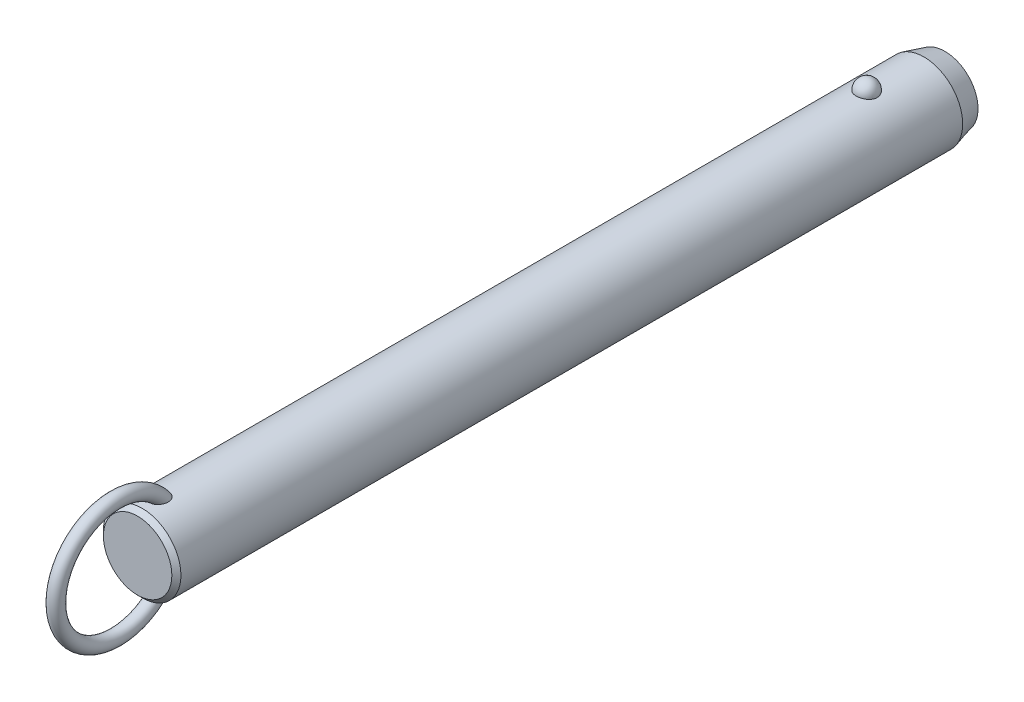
ISO-10303-21;
HEADER;
FILE_DESCRIPTION(('STEP AP214'),'2;1');
FILE_NAME('part.step','',(''),(''),'','','');
FILE_SCHEMA(('AUTOMOTIVE_DESIGN { 1 0 10303 214 1 1 1 1 }'));
ENDSEC;
DATA;
#1=APPLICATION_CONTEXT('core data for automotive mechanical design processes');
#2=APPLICATION_PROTOCOL_DEFINITION('international standard','automotive_design',2000,#1);
#3=PRODUCT_CONTEXT('',#1,'mechanical');
#4=PRODUCT('Part','Part','',(#3));
#5=PRODUCT_RELATED_PRODUCT_CATEGORY('part','',(#4));
#6=PRODUCT_DEFINITION_FORMATION('','',#4);
#7=PRODUCT_DEFINITION_CONTEXT('part definition',#1,'design');
#8=PRODUCT_DEFINITION('design','',#6,#7);
#9=PRODUCT_DEFINITION_SHAPE('','',#8);
#10=(LENGTH_UNIT() NAMED_UNIT(*) SI_UNIT(.MILLI.,.METRE.));
#11=(NAMED_UNIT(*) PLANE_ANGLE_UNIT() SI_UNIT($,.RADIAN.));
#12=(NAMED_UNIT(*) SI_UNIT($,.STERADIAN.) SOLID_ANGLE_UNIT());
#13=UNCERTAINTY_MEASURE_WITH_UNIT(LENGTH_MEASURE(1.E-05),#10,'distance_accuracy_value','');
#14=(GEOMETRIC_REPRESENTATION_CONTEXT(3) GLOBAL_UNCERTAINTY_ASSIGNED_CONTEXT((#13)) GLOBAL_UNIT_ASSIGNED_CONTEXT((#10,
#11,#12)) REPRESENTATION_CONTEXT('',''));
#15=CARTESIAN_POINT('',(0.,0.,0.));
#16=DIRECTION('',(0.,0.,1.));
#17=DIRECTION('',(1.,0.,0.));
#18=AXIS2_PLACEMENT_3D('',#15,#16,#17);
#19=CARTESIAN_POINT('',(0.,0.,193.));
#20=DIRECTION('',(0.,0.,-1.));
#21=DIRECTION('',(-1.,0.,0.));
#22=AXIS2_PLACEMENT_3D('',#19,#20,#21);
#23=CYLINDRICAL_SURFACE('',#22,11.1);
#24=CARTESIAN_POINT('',(2.9724815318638,10.6945945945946,-3.00000000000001));
#25=CARTESIAN_POINT('',(2.97247830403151,10.6945972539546,-2.8322505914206));
#26=CARTESIAN_POINT('',(2.95876598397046,10.6984356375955,-2.66445972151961));
#27=CARTESIAN_POINT('',(2.90424529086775,10.7133624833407,-2.3336238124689));
#28=CARTESIAN_POINT('',(2.8634252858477,10.7244540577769,-2.17058084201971));
#29=CARTESIAN_POINT('',(2.75573657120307,10.7526272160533,-1.85396767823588));
#30=CARTESIAN_POINT('',(2.68887937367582,10.7697061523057,-1.70039333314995));
#31=CARTESIAN_POINT('',(2.53079696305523,10.8079438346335,-1.4069159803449));
#32=CARTESIAN_POINT('',(2.43957264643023,10.8291024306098,-1.26701246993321));
#33=CARTESIAN_POINT('',(2.23458150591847,10.8732541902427,-1.00409565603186));
#34=CARTESIAN_POINT('',(2.12071295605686,10.8962553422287,-0.881162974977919));
#35=CARTESIAN_POINT('',(1.87365402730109,10.9414421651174,-0.656352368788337));
#36=CARTESIAN_POINT('',(1.74046358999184,10.9636278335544,-0.554474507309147));
#37=CARTESIAN_POINT('',(1.45872188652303,11.0046495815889,-0.374872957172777));
#38=CARTESIAN_POINT('',(1.31021276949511,11.0234944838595,-0.297085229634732));
#39=CARTESIAN_POINT('',(1.00170030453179,11.0557957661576,-0.167529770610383));
#40=CARTESIAN_POINT('',(0.841698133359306,11.0692526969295,-0.1157593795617));
#41=CARTESIAN_POINT('',(0.517607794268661,11.0890932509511,-0.0403925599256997));
#42=CARTESIAN_POINT('',(0.353633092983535,11.0955916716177,-0.0163383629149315));
#43=CARTESIAN_POINT('',(0.0238420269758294,11.1011989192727,0.00445177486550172));
#44=CARTESIAN_POINT('',(-0.141974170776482,11.1003084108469,0.00119017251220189));
#45=CARTESIAN_POINT('',(-0.468405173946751,11.0912990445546,-0.0323233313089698));
#46=CARTESIAN_POINT('',(-0.629059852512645,11.0832767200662,-0.062214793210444));
#47=CARTESIAN_POINT('',(-0.942937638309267,11.0609962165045,-0.147645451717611));
#48=CARTESIAN_POINT('',(-1.09616062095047,11.0467379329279,-0.203185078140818));
#49=CARTESIAN_POINT('',(-1.39181061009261,11.0134071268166,-0.338752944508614));
#50=CARTESIAN_POINT('',(-1.53417383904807,10.9943086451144,-0.418913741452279));
#51=CARTESIAN_POINT('',(-1.80342160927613,10.9533667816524,-0.601448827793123));
#52=CARTESIAN_POINT('',(-1.9303046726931,10.9315231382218,-0.703825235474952));
#53=CARTESIAN_POINT('',(-2.16747598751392,10.887005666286,-0.930091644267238));
#54=CARTESIAN_POINT('',(-2.27742774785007,10.8643239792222,-1.05433291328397));
#55=CARTESIAN_POINT('',(-2.47517316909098,10.8209886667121,-1.31966633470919));
#56=CARTESIAN_POINT('',(-2.56296538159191,10.8003351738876,-1.46075958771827));
#57=CARTESIAN_POINT('',(-2.71500300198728,10.7631304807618,-1.75753646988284));
#58=CARTESIAN_POINT('',(-2.77898901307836,10.7466250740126,-1.91335887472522));
#59=CARTESIAN_POINT('',(-2.88046189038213,10.7198747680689,-2.23391529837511));
#60=CARTESIAN_POINT('',(-2.91794947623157,10.709629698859,-2.3986490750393));
#61=CARTESIAN_POINT('',(-2.96537819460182,10.6965949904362,-2.73165170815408));
#62=CARTESIAN_POINT('',(-2.97542891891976,10.693775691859,-2.89990378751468));
#63=CARTESIAN_POINT('',(-2.96804271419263,10.6958279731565,-3.23575286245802));
#64=CARTESIAN_POINT('',(-2.95060646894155,10.7006993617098,-3.4033498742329));
#65=CARTESIAN_POINT('',(-2.88883358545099,10.71753912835,-3.73233906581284));
#66=CARTESIAN_POINT('',(-2.84462026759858,10.7294749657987,-3.89375610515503));
#67=CARTESIAN_POINT('',(-2.73050447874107,10.7590797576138,-4.20667949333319));
#68=CARTESIAN_POINT('',(-2.66060103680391,10.7767489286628,-4.35818546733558));
#69=CARTESIAN_POINT('',(-2.49642559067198,10.8159599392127,-4.64785421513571));
#70=CARTESIAN_POINT('',(-2.40203047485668,10.8375211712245,-4.78594458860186));
#71=CARTESIAN_POINT('',(-2.19143488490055,10.8820570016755,-5.04410382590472));
#72=CARTESIAN_POINT('',(-2.07523364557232,10.9050316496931,-5.16417205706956));
#73=CARTESIAN_POINT('',(-1.82361254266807,10.9499219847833,-5.3833483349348));
#74=CARTESIAN_POINT('',(-1.68812945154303,10.9718338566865,-5.48238464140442));
#75=CARTESIAN_POINT('',(-1.40191298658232,11.0120611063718,-5.65618873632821));
#76=CARTESIAN_POINT('',(-1.25118062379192,11.0303767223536,-5.73095813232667));
#77=CARTESIAN_POINT('',(-0.940570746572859,11.0611653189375,-5.85334725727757));
#78=CARTESIAN_POINT('',(-0.780821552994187,11.0737044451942,-5.90127578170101));
#79=CARTESIAN_POINT('',(-0.455204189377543,11.0918598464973,-5.96992976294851));
#80=CARTESIAN_POINT('',(-0.289336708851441,11.0974768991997,-5.99065827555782));
#81=CARTESIAN_POINT('',(0.0406846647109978,11.1011307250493,-6.00418773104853));
#82=CARTESIAN_POINT('',(0.204817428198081,11.099299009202,-5.9974731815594));
#83=CARTESIAN_POINT('',(0.5295530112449,11.088551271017,-5.95740317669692));
#84=CARTESIAN_POINT('',(0.69015594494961,11.0796354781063,-5.92404858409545));
#85=CARTESIAN_POINT('',(1.0027760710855,11.0557204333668,-5.83180084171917));
#86=CARTESIAN_POINT('',(1.15482001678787,11.0407414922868,-5.7729929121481));
#87=CARTESIAN_POINT('',(1.44678373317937,11.0062913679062,-5.63147366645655));
#88=CARTESIAN_POINT('',(1.58670279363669,10.9868199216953,-5.54876095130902));
#89=CARTESIAN_POINT('',(1.8527023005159,10.9451315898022,-5.36027644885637));
#90=CARTESIAN_POINT('',(1.97855158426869,10.9228788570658,-5.25418644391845));
#91=CARTESIAN_POINT('',(2.21080872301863,10.8782509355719,-5.02251354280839));
#92=CARTESIAN_POINT('',(2.31721312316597,10.8558757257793,-4.89692718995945));
#93=CARTESIAN_POINT('',(2.5094551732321,10.8130715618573,-4.62745408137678));
#94=CARTESIAN_POINT('',(2.59493284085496,10.7926798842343,-4.48330448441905));
#95=CARTESIAN_POINT('',(2.740862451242,10.7565495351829,-4.18236358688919));
#96=CARTESIAN_POINT('',(2.80132490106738,10.7408089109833,-4.02557762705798));
#97=CARTESIAN_POINT('',(2.88959070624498,10.7173718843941,-3.72475308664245));
#98=CARTESIAN_POINT('',(2.92062102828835,10.7088950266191,-3.58171216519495));
#99=CARTESIAN_POINT('',(2.96206765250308,10.6975052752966,-3.29245795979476));
#100=CARTESIAN_POINT('',(2.97248434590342,10.6945922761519,-3.14624473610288));
#101=CARTESIAN_POINT('',(2.9724815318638,10.6945945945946,-3.00000000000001));
#102=B_SPLINE_CURVE_WITH_KNOTS('',3,(#24,#25,#26,#27,#28,#29,#30,#31,#32,#33,#34,#35,#36,#37,
#38,#39,#40,#41,#42,#43,#44,#45,#46,#47,#48,#49,#50,#51,#52,#53,#54,#55,#56,#57,#58,#59,#60,#61,
#62,#63,#64,#65,#66,#67,#68,#69,#70,#71,#72,#73,#74,#75,#76,#77,#78,#79,#80,#81,#82,#83,#84,#85,
#86,#87,#88,#89,#90,#91,#92,#93,#94,#95,#96,#97,#98,#99,#100,#101),.UNSPECIFIED.,.T.,.F.,(4,2,2,
2,2,2,2,2,2,2,2,2,2,2,2,2,2,2,2,2,2,2,2,2,2,2,2,2,2,2,2,2,2,2,2,2,2,2,4),(0.,0.502722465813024,
1.00566079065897,1.5083769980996,2.01107471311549,2.51608392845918,3.02109467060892,
3.52475118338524,4.02835620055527,4.523518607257,5.0186364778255,5.50715297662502,
5.9956776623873,6.48688002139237,6.97812923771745,7.47814366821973,7.9781907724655,
8.48353712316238,8.9888697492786,9.49218093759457,9.99547960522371,10.4964777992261,
10.997494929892,11.5010810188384,12.0046847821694,12.5099796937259,13.0152411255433,
13.5145635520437,14.0138298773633,14.5043200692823,14.9947943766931,15.4836390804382,
15.9725123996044,16.4685040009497,16.9645836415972,17.4686765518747,17.972557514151,
18.410841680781,18.849117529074),.UNSPECIFIED.);
#103=CARTESIAN_POINT('',(2.9724815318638,10.6945945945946,-3.00000000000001));
#104=VERTEX_POINT('',#103);
#105=EDGE_CURVE('E41',#104,#104,#102,.T.);
#106=ORIENTED_EDGE('',*,*,#105,.T.);
#107=EDGE_LOOP('',(#106));
#108=FACE_BOUND('',#107,.T.);
#109=CARTESIAN_POINT('',(0.,0.,204.4));
#110=DIRECTION('',(0.,0.,1.));
#111=DIRECTION('',(1.,0.,0.));
#112=AXIS2_PLACEMENT_3D('',#109,#110,#111);
#113=CIRCLE('',#112,11.1);
#114=CARTESIAN_POINT('',(11.1,0.,204.4));
#115=VERTEX_POINT('',#114);
#116=EDGE_CURVE('E10',#115,#115,#113,.F.);
#117=ORIENTED_EDGE('',*,*,#116,.T.);
#118=EDGE_LOOP('',(#117));
#119=FACE_BOUND('',#118,.T.);
#120=CARTESIAN_POINT('',(-0.564520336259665,-11.0856356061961,196.657815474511));
#121=CARTESIAN_POINT('',(-0.667202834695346,-11.0804062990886,196.691283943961));
#122=CARTESIAN_POINT('',(-0.766875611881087,-11.0738877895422,196.733835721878));
#123=CARTESIAN_POINT('',(-0.95728412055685,-11.0590576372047,196.835419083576));
#124=CARTESIAN_POINT('',(-1.04801616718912,-11.0507452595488,196.89445742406));
#125=CARTESIAN_POINT('',(-1.21800952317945,-11.0333016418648,197.026529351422));
#126=CARTESIAN_POINT('',(-1.2973080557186,-11.0241732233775,197.099515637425));
#127=CARTESIAN_POINT('',(-1.44337665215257,-11.0060026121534,197.257037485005));
#128=CARTESIAN_POINT('',(-1.51014622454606,-10.9969604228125,197.341573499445));
#129=CARTESIAN_POINT('',(-1.63454620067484,-10.9791841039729,197.525521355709));
#130=CARTESIAN_POINT('',(-1.69127003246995,-10.9705107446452,197.625549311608));
#131=CARTESIAN_POINT('',(-1.7898078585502,-10.9548648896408,197.832790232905));
#132=CARTESIAN_POINT('',(-1.83161214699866,-10.9478935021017,197.940007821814));
#133=CARTESIAN_POINT('',(-1.91557028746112,-10.9335803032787,198.205408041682));
#134=CARTESIAN_POINT('',(-1.95040620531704,-10.9273269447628,198.365980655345));
#135=CARTESIAN_POINT('',(-1.99388326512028,-10.9194709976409,198.690697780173));
#136=CARTESIAN_POINT('',(-2.00248051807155,-10.9178762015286,198.854847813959));
#137=CARTESIAN_POINT('',(-1.99551615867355,-10.9191578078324,199.224650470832));
#138=CARTESIAN_POINT('',(-1.9732206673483,-10.9232807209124,199.430191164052));
#139=CARTESIAN_POINT('',(-1.9152976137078,-10.9335244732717,199.733595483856));
#140=CARTESIAN_POINT('',(-1.89184575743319,-10.9376266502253,199.834088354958));
#141=CARTESIAN_POINT('',(-1.83700674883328,-10.9469720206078,200.032855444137));
#142=CARTESIAN_POINT('',(-1.80562070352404,-10.9522150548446,200.131129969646));
#143=CARTESIAN_POINT('',(-1.73463055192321,-10.9636837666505,200.325914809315));
#144=CARTESIAN_POINT('',(-1.69493416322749,-10.9699202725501,200.422390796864));
#145=CARTESIAN_POINT('',(-1.60745141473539,-10.9830806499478,200.611626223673));
#146=CARTESIAN_POINT('',(-1.55966150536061,-10.9900048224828,200.704384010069));
#147=CARTESIAN_POINT('',(-1.45591812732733,-11.0042280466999,200.884690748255));
#148=CARTESIAN_POINT('',(-1.40000013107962,-11.0115253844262,200.972260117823));
#149=CARTESIAN_POINT('',(-1.27937470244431,-11.0261911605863,201.141029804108));
#150=CARTESIAN_POINT('',(-1.21467835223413,-11.0335594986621,201.22223795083));
#151=CARTESIAN_POINT('',(-1.08218150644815,-11.0473027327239,201.369001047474));
#152=CARTESIAN_POINT('',(-1.01522633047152,-11.0537063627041,201.435309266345));
#153=CARTESIAN_POINT('',(-0.872952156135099,-11.065850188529,201.558378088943));
#154=CARTESIAN_POINT('',(-0.797642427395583,-11.0715911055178,201.615149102));
#155=CARTESIAN_POINT('',(-0.651396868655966,-11.081071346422,201.707515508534));
#156=CARTESIAN_POINT('',(-0.581712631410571,-11.0849841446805,201.745049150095));
#157=CARTESIAN_POINT('',(-0.437066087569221,-11.0916271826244,201.808259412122));
#158=CARTESIAN_POINT('',(-0.362109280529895,-11.0943586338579,201.833948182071));
#159=CARTESIAN_POINT('',(-0.207828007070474,-11.0983242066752,201.871117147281));
#160=CARTESIAN_POINT('',(-0.12846771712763,-11.0995432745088,201.882454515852));
#161=CARTESIAN_POINT('',(0.0309101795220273,-11.1002423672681,201.888965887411));
#162=CARTESIAN_POINT('',(0.110927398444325,-11.0997233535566,201.884148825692));
#163=CARTESIAN_POINT('',(0.25640659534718,-11.097240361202,201.860959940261));
#164=CARTESIAN_POINT('',(0.322235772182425,-11.0955074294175,201.844754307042));
#165=CARTESIAN_POINT('',(0.450635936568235,-11.0910350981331,201.802600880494));
#166=CARTESIAN_POINT('',(0.513205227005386,-11.0882951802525,201.776648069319));
#167=CARTESIAN_POINT('',(0.662626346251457,-11.0805620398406,201.702607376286));
#168=CARTESIAN_POINT('',(0.747127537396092,-11.0751144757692,201.649845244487));
#169=CARTESIAN_POINT('',(0.906756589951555,-11.0631932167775,201.531720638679));
#170=CARTESIAN_POINT('',(0.981859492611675,-11.0567168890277,201.466325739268));
#171=CARTESIAN_POINT('',(1.10712207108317,-11.0447856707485,201.34226337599));
#172=CARTESIAN_POINT('',(1.15909566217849,-11.0394280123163,201.285383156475));
#173=CARTESIAN_POINT('',(1.2579192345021,-11.0286040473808,201.167327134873));
#174=CARTESIAN_POINT('',(1.30476642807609,-11.0231376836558,201.106149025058));
#175=CARTESIAN_POINT('',(1.43818612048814,-11.0068027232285,200.917305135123));
#176=CARTESIAN_POINT('',(1.51751767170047,-10.9960104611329,200.784453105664));
#177=CARTESIAN_POINT('',(1.63597546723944,-10.9788847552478,200.553137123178));
#178=CARTESIAN_POINT('',(1.67988876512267,-10.9722190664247,200.457053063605));
#179=CARTESIAN_POINT('',(1.75953241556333,-10.9597298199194,200.261431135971));
#180=CARTESIAN_POINT('',(1.7952596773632,-10.9539065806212,200.161891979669));
#181=CARTESIAN_POINT('',(1.85844731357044,-10.9433632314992,199.96021118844));
#182=CARTESIAN_POINT('',(1.88591073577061,-10.9386427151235,199.85807052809));
#183=CARTESIAN_POINT('',(1.93234324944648,-10.9305350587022,199.651819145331));
#184=CARTESIAN_POINT('',(1.95131065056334,-10.9271481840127,199.547708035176));
#185=CARTESIAN_POINT('',(1.9904020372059,-10.9201183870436,199.265458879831));
#186=CARTESIAN_POINT('',(2.00221217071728,-10.9179256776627,199.086037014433));
#187=CARTESIAN_POINT('',(1.99711676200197,-10.9188636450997,198.727713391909));
#188=CARTESIAN_POINT('',(1.98026150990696,-10.9219849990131,198.548811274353));
#189=CARTESIAN_POINT('',(1.92151657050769,-10.9324473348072,198.23645144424));
#190=CARTESIAN_POINT('',(1.88605081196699,-10.9386915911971,198.101759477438));
#191=CARTESIAN_POINT('',(1.79393020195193,-10.9541780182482,197.839966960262));
#192=CARTESIAN_POINT('',(1.73729868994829,-10.9634168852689,197.712858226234));
#193=CARTESIAN_POINT('',(1.61237037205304,-10.9824218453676,197.489418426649));
#194=CARTESIAN_POINT('',(1.54715374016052,-10.9918945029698,197.391345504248));
#195=CARTESIAN_POINT('',(1.40127026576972,-11.0114415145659,197.207434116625));
#196=CARTESIAN_POINT('',(1.32060742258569,-11.0215157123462,197.121592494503));
#197=CARTESIAN_POINT('',(1.1447478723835,-11.041168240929,196.965163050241));
#198=CARTESIAN_POINT('',(1.04947805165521,-11.0507437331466,196.894656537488));
#199=CARTESIAN_POINT('',(0.847278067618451,-11.0680789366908,196.772640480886));
#200=CARTESIAN_POINT('',(0.74035174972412,-11.0758392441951,196.721124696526));
#201=CARTESIAN_POINT('',(0.529289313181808,-11.0878275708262,196.643485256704));
#202=CARTESIAN_POINT('',(0.425895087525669,-11.0923259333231,196.615377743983));
#203=CARTESIAN_POINT('',(0.215723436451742,-11.0984001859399,196.577703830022));
#204=CARTESIAN_POINT('',(0.108947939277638,-11.0999777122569,196.568127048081));
#205=CARTESIAN_POINT('',(-0.0938962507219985,-11.1000196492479,196.567877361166));
#206=CARTESIAN_POINT('',(-0.189967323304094,-11.0987797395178,196.575408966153));
#207=CARTESIAN_POINT('',(-0.379657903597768,-11.0939111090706,196.605507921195));
#208=CARTESIAN_POINT('',(-0.47327735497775,-11.0902823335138,196.628075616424));
#209=CARTESIAN_POINT('',(-0.564520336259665,-11.0856356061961,196.657815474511));
#210=B_SPLINE_CURVE_WITH_KNOTS('',3,(#120,#121,#122,#123,#124,#125,#126,#127,#128,#129,#130,
#131,#132,#133,#134,#135,#136,#137,#138,#139,#140,#141,#142,#143,#144,#145,#146,#147,#148,#149,
#150,#151,#152,#153,#154,#155,#156,#157,#158,#159,#160,#161,#162,#163,#164,#165,#166,#167,#168,
#169,#170,#171,#172,#173,#174,#175,#176,#177,#178,#179,#180,#181,#182,#183,#184,#185,#186,#187,
#188,#189,#190,#191,#192,#193,#194,#195,#196,#197,#198,#199,#200,#201,#202,#203,#204,#205,#206,
#207,#208,#209),.UNSPECIFIED.,.T.,.F.,(4,2,2,2,2,2,2,2,2,2,2,2,2,2,2,2,2,2,2,2,2,2,2,2,2,2,2,2,
2,2,2,2,2,2,2,2,2,2,2,2,2,2,2,2,4),(0.,0.323999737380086,0.64813245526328,0.971184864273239,
1.29424994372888,1.63886237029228,1.98369857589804,2.47426059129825,2.96564271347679,
3.58257396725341,3.89215258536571,4.20168803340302,4.51486273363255,4.82817514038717,
5.14015911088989,5.45175282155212,5.73442856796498,6.01679375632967,6.2536458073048,
6.49025437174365,6.72919963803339,6.96801276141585,7.17061258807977,7.37331685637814,
7.67094989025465,7.96935728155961,8.20075067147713,8.43226927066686,8.89581623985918,
9.21306533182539,9.53043400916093,9.84768549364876,10.1650000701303,10.7022930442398,
11.2386443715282,11.655339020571,12.071575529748,12.4245637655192,12.7774607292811,
13.1321855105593,13.4867936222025,13.8068771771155,14.1267813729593,14.4146787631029,
14.7025827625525),.UNSPECIFIED.);
#211=CARTESIAN_POINT('',(-0.564520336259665,-11.0856356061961,196.657815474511));
#212=VERTEX_POINT('',#211);
#213=EDGE_CURVE('E59',#212,#212,#210,.T.);
#214=ORIENTED_EDGE('',*,*,#213,.T.);
#215=EDGE_LOOP('',(#214));
#216=FACE_BOUND('',#215,.T.);
#217=CARTESIAN_POINT('',(-0.564520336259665,11.0856356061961,196.657815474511));
#218=CARTESIAN_POINT('',(-0.468542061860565,11.0905203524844,196.626545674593));
#219=CARTESIAN_POINT('',(-0.369793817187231,11.0942886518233,196.603157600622));
#220=CARTESIAN_POINT('',(-0.169555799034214,11.0991586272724,196.573085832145));
#221=CARTESIAN_POINT('',(-0.0680604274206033,11.1002543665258,196.56643932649));
#222=CARTESIAN_POINT('',(0.134549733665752,11.099646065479,196.570157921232));
#223=CARTESIAN_POINT('',(0.235664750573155,11.0979441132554,196.58051033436));
#224=CARTESIAN_POINT('',(0.434632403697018,11.0919342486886,196.617831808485));
#225=CARTESIAN_POINT('',(0.532486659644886,11.0876276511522,196.644792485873));
#226=CARTESIAN_POINT('',(0.722445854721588,11.0768742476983,196.7144096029));
#227=CARTESIAN_POINT('',(0.814543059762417,11.0704246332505,196.757086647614));
#228=CARTESIAN_POINT('',(0.990565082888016,11.0560659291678,196.856648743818));
#229=CARTESIAN_POINT('',(1.07448844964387,11.048156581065,196.913536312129));
#230=CARTESIAN_POINT('',(1.23562672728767,11.0313221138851,197.042210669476));
#231=CARTESIAN_POINT('',(1.3124268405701,11.0223686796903,197.114511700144));
#232=CARTESIAN_POINT('',(1.45398030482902,11.0045918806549,197.270042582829));
#233=CARTESIAN_POINT('',(1.51873073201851,10.9957685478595,197.353275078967));
#234=CARTESIAN_POINT('',(1.64107232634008,10.9782087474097,197.536384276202));
#235=CARTESIAN_POINT('',(1.6974317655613,10.9695572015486,197.637089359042));
#236=CARTESIAN_POINT('',(1.79515063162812,10.9539887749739,197.845626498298));
#237=CARTESIAN_POINT('',(1.83649966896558,10.9470730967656,197.95346343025));
#238=CARTESIAN_POINT('',(1.91931148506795,10.9329211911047,198.220399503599));
#239=CARTESIAN_POINT('',(1.95340104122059,10.9267904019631,198.381861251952));
#240=CARTESIAN_POINT('',(1.99526195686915,10.9192174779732,198.70821631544));
#241=CARTESIAN_POINT('',(2.00298989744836,10.9177830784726,198.87311484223));
#242=CARTESIAN_POINT('',(1.99396251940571,10.9194420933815,199.244100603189));
#243=CARTESIAN_POINT('',(1.97050829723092,10.923774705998,199.45003871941));
#244=CARTESIAN_POINT('',(1.91079643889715,10.9343131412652,199.753901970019));
#245=CARTESIAN_POINT('',(1.88673702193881,10.9385106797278,199.854529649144));
#246=CARTESIAN_POINT('',(1.8306550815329,10.9480376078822,200.053510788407));
#247=CARTESIAN_POINT('',(1.79863369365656,10.9533668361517,200.151864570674));
#248=CARTESIAN_POINT('',(1.72633365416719,10.9649954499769,200.346720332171));
#249=CARTESIAN_POINT('',(1.68596409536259,10.9713053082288,200.44318790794));
#250=CARTESIAN_POINT('',(1.59707998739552,10.9845964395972,200.632323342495));
#251=CARTESIAN_POINT('',(1.54856169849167,10.9915780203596,200.724989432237));
#252=CARTESIAN_POINT('',(1.44330168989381,11.0058935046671,200.904975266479));
#253=CARTESIAN_POINT('',(1.3865974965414,11.0132257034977,200.992316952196));
#254=CARTESIAN_POINT('',(1.26431158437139,11.0279330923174,201.160456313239));
#255=CARTESIAN_POINT('',(1.19874160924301,11.0353082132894,201.241262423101));
#256=CARTESIAN_POINT('',(1.06542088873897,11.048931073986,201.385985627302));
#257=CARTESIAN_POINT('',(0.998640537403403,11.0552153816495,201.450784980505));
#258=CARTESIAN_POINT('',(0.856896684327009,11.0671032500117,201.570846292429));
#259=CARTESIAN_POINT('',(0.781942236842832,11.0727075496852,201.626118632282));
#260=CARTESIAN_POINT('',(0.636276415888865,11.081949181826,201.715972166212));
#261=CARTESIAN_POINT('',(0.566755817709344,11.0857572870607,201.752441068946));
#262=CARTESIAN_POINT('',(0.422602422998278,11.0921860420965,201.813533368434));
#263=CARTESIAN_POINT('',(0.347974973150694,11.0948079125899,201.838168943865));
#264=CARTESIAN_POINT('',(0.194593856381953,11.0985608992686,201.873323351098));
#265=CARTESIAN_POINT('',(0.115807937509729,11.0996777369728,201.883706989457));
#266=CARTESIAN_POINT('',(-0.0422499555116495,11.1002003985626,201.888574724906));
#267=CARTESIAN_POINT('',(-0.121521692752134,11.09960699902,201.883066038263));
#268=CARTESIAN_POINT('',(-0.26604624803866,11.0970123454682,201.858827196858));
#269=CARTESIAN_POINT('',(-0.331661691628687,11.0952283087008,201.842135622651));
#270=CARTESIAN_POINT('',(-0.459588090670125,11.0906663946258,201.799111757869));
#271=CARTESIAN_POINT('',(-0.521897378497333,11.0878880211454,201.772774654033));
#272=CARTESIAN_POINT('',(-0.671446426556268,11.0800342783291,201.697513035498));
#273=CARTESIAN_POINT('',(-0.756250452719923,11.0744969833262,201.643818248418));
#274=CARTESIAN_POINT('',(-0.916349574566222,11.0624045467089,201.523802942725));
#275=CARTESIAN_POINT('',(-0.991618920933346,11.0558467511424,201.457449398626));
#276=CARTESIAN_POINT('',(-1.11713140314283,11.0437783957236,201.331633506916));
#277=CARTESIAN_POINT('',(-1.16920539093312,11.0383619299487,201.273952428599));
#278=CARTESIAN_POINT('',(-1.26817476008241,11.02743010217,201.154280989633));
#279=CARTESIAN_POINT('',(-1.31506731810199,11.0219146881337,201.092288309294));
#280=CARTESIAN_POINT('',(-1.40399813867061,11.0109399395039,200.964784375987));
#281=CARTESIAN_POINT('',(-1.44602864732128,11.0054807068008,200.899267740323));
#282=CARTESIAN_POINT('',(-1.52538779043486,10.9947621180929,200.765422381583));
#283=CARTESIAN_POINT('',(-1.56271516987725,10.9895028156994,200.697092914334));
#284=CARTESIAN_POINT('',(-1.64537943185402,10.9774790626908,200.533210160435));
#285=CARTESIAN_POINT('',(-1.68879497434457,10.9708503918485,200.4366735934));
#286=CARTESIAN_POINT('',(-1.76740738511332,10.9584602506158,200.240236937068));
#287=CARTESIAN_POINT('',(-1.80260120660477,10.95269910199,200.14033561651));
#288=CARTESIAN_POINT('',(-1.86468657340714,10.9423003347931,199.937966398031));
#289=CARTESIAN_POINT('',(-1.8915816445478,10.9376622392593,199.835499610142));
#290=CARTESIAN_POINT('',(-1.93682458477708,10.9297405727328,199.628642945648));
#291=CARTESIAN_POINT('',(-1.95517082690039,10.9264572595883,199.524252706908));
#292=CARTESIAN_POINT('',(-1.99232562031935,10.9197647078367,199.24262876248));
#293=CARTESIAN_POINT('',(-2.00294603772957,10.9177914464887,199.064185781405));
#294=CARTESIAN_POINT('',(-1.99566675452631,10.9191290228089,198.707996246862));
#295=CARTESIAN_POINT('',(-1.97781651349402,10.9224306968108,198.53024902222));
#296=CARTESIAN_POINT('',(-1.91747214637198,10.9331592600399,198.219792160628));
#297=CARTESIAN_POINT('',(-1.88131022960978,10.9395108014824,198.085825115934));
#298=CARTESIAN_POINT('',(-1.78790380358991,10.9551659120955,197.82559757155));
#299=CARTESIAN_POINT('',(-1.73068309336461,10.9644661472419,197.699328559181));
#300=CARTESIAN_POINT('',(-1.60475573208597,10.9835398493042,197.47741565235));
#301=CARTESIAN_POINT('',(-1.53908879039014,10.9930297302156,197.380026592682));
#302=CARTESIAN_POINT('',(-1.39238608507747,11.0125708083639,197.197525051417));
#303=CARTESIAN_POINT('',(-1.31135150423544,11.0226219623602,197.112411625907));
#304=CARTESIAN_POINT('',(-1.14382035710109,11.0411991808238,196.96529943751));
#305=CARTESIAN_POINT('',(-1.0585850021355,11.0497792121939,196.90186930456));
#306=CARTESIAN_POINT('',(-0.878723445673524,11.0655285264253,196.790250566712));
#307=CARTESIAN_POINT('',(-0.784123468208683,11.0727015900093,196.742020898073));
#308=CARTESIAN_POINT('',(-0.646163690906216,11.0812501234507,196.686023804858));
#309=CARTESIAN_POINT('',(-0.605595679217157,11.0835451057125,196.671197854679));
#310=CARTESIAN_POINT('',(-0.564520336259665,11.0856356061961,196.657815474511));
#311=B_SPLINE_CURVE_WITH_KNOTS('',3,(#217,#218,#219,#220,#221,#222,#223,#224,#225,#226,#227,
#228,#229,#230,#231,#232,#233,#234,#235,#236,#237,#238,#239,#240,#241,#242,#243,#244,#245,#246,
#247,#248,#249,#250,#251,#252,#253,#254,#255,#256,#257,#258,#259,#260,#261,#262,#263,#264,#265,
#266,#267,#268,#269,#270,#271,#272,#273,#274,#275,#276,#277,#278,#279,#280,#281,#282,#283,#284,
#285,#286,#287,#288,#289,#290,#291,#292,#293,#294,#295,#296,#297,#298,#299,#300,#301,#302,#303,
#304,#305,#306,#307,#308,#309,#310),.UNSPECIFIED.,.T.,.F.,(4,2,2,2,2,2,2,2,2,2,2,2,2,2,2,2,2,2,
2,2,2,2,2,2,2,2,2,2,2,2,2,2,2,2,2,2,2,2,2,2,2,2,2,2,2,2,4),(0.,0.303061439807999,
0.606795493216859,0.910302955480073,1.21365733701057,1.51741085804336,1.82121821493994,
2.13745205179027,2.45376252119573,2.79958678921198,3.14564996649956,3.63832391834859,
4.13180893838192,4.75031912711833,5.06071926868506,5.37107516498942,5.6850077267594,
5.99908475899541,6.31176519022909,6.62403542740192,6.90315673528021,7.18197194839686,
7.41687778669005,7.65154134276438,7.88841587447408,8.12518286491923,8.32752842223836,
8.52997509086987,8.82986421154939,9.13054668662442,9.36393502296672,9.59744991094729,
9.83133221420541,10.0652767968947,10.383032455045,10.7009056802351,11.0186436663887,
11.3364420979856,11.8705925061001,12.4038159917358,12.8189662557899,13.2336487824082,
13.5857049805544,13.9377340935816,14.2561354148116,14.5736690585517,14.7033687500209),.UNSPECIFIED.);
#312=CARTESIAN_POINT('',(-0.564520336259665,11.0856356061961,196.657815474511));
#313=VERTEX_POINT('',#312);
#314=EDGE_CURVE('E67',#313,#313,#311,.T.);
#315=ORIENTED_EDGE('',*,*,#314,.T.);
#316=EDGE_LOOP('',(#315));
#317=FACE_BOUND('',#316,.T.);
#318=CARTESIAN_POINT('',(0.,0.,-19.3999999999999));
#319=DIRECTION('',(0.,0.,-1.));
#320=DIRECTION('',(-1.,0.,0.));
#321=AXIS2_PLACEMENT_3D('',#318,#319,#320);
#322=CIRCLE('',#321,11.1);
#323=CARTESIAN_POINT('',(-11.1,0.,-19.3999999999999));
#324=VERTEX_POINT('',#323);
#325=EDGE_CURVE('E56',#324,#324,#322,.F.);
#326=ORIENTED_EDGE('',*,*,#325,.T.);
#327=EDGE_LOOP('',(#326));
#328=FACE_BOUND('',#327,.T.);
#329=ADVANCED_FACE('F37',(#108,#119,#216,#317,#328),#23,.T.);
#330=CARTESIAN_POINT('',(0.,0.,-25.4));
#331=DIRECTION('',(0.,0.,-1.));
#332=DIRECTION('',(-1.,0.,0.));
#333=AXIS2_PLACEMENT_3D('',#330,#331,#332);
#334=PLANE('',#333);
#335=CARTESIAN_POINT('',(0.,0.,-25.4));
#336=DIRECTION('',(0.,0.,-1.));
#337=DIRECTION('',(-1.,0.,0.));
#338=AXIS2_PLACEMENT_3D('',#335,#336,#337);
#339=CIRCLE('',#338,9.49230484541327);
#340=CARTESIAN_POINT('',(-9.49230484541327,0.,-25.4));
#341=VERTEX_POINT('',#340);
#342=EDGE_CURVE('E66',#341,#341,#339,.T.);
#343=ORIENTED_EDGE('',*,*,#342,.T.);
#344=EDGE_LOOP('',(#343));
#345=FACE_BOUND('',#344,.T.);
#346=ADVANCED_FACE('F85',(#345),#334,.T.);
#347=CARTESIAN_POINT('',(0.,0.,-25.4));
#348=DIRECTION('',(0.,0.,1.));
#349=DIRECTION('',(1.,0.,0.));
#350=AXIS2_PLACEMENT_3D('',#347,#348,#349);
#351=CONICAL_SURFACE('',#350,9.49230484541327,0.261799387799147);
#352=ORIENTED_EDGE('',*,*,#325,.F.);
#353=EDGE_LOOP('',(#352));
#354=FACE_BOUND('',#353,.T.);
#355=ORIENTED_EDGE('',*,*,#342,.F.);
#356=EDGE_LOOP('',(#355));
#357=FACE_BOUND('',#356,.T.);
#358=ADVANCED_FACE('F83',(#354,#357),#351,.T.);
#359=CARTESIAN_POINT('',(0.,0.,205.7));
#360=DIRECTION('',(0.,0.,1.));
#361=DIRECTION('',(1.,0.,0.));
#362=AXIS2_PLACEMENT_3D('',#359,#360,#361);
#363=PLANE('',#362);
#364=CARTESIAN_POINT('',(0.,0.,205.7));
#365=DIRECTION('',(0.,0.,1.));
#366=DIRECTION('',(1.,0.,0.));
#367=AXIS2_PLACEMENT_3D('',#364,#365,#366);
#368=CIRCLE('',#367,9.80000000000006);
#369=CARTESIAN_POINT('',(9.80000000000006,0.,205.7));
#370=VERTEX_POINT('',#369);
#371=EDGE_CURVE('E50',#370,#370,#368,.T.);
#372=ORIENTED_EDGE('',*,*,#371,.T.);
#373=EDGE_LOOP('',(#372));
#374=FACE_BOUND('',#373,.T.);
#375=ADVANCED_FACE('F77',(#374),#363,.T.);
#376=CARTESIAN_POINT('',(0.,0.,212.05));
#377=DIRECTION('',(1.,0.,0.));
#378=DIRECTION('',(0.,0.,-1.));
#379=AXIS2_PLACEMENT_3D('',#376,#377,#378);
#380=TOROIDAL_SURFACE('',#379,17.05,2.);
#381=ORIENTED_EDGE('',*,*,#314,.F.);
#382=EDGE_LOOP('',(#381));
#383=FACE_BOUND('',#382,.T.);
#384=ORIENTED_EDGE('',*,*,#213,.F.);
#385=EDGE_LOOP('',(#384));
#386=FACE_BOUND('',#385,.T.);
#387=ADVANCED_FACE('F73',(#383,#386),#380,.T.);
#388=CARTESIAN_POINT('',(0.,0.,205.7));
#389=DIRECTION('',(0.,0.,-1.));
#390=DIRECTION('',(-1.,0.,0.));
#391=AXIS2_PLACEMENT_3D('',#388,#389,#390);
#392=CONICAL_SURFACE('',#391,9.80000000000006,0.785398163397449);
#393=ORIENTED_EDGE('',*,*,#116,.F.);
#394=EDGE_LOOP('',(#393));
#395=FACE_BOUND('',#394,.T.);
#396=ORIENTED_EDGE('',*,*,#371,.F.);
#397=EDGE_LOOP('',(#396));
#398=FACE_BOUND('',#397,.T.);
#399=ADVANCED_FACE('F39',(#395,#398),#392,.T.);
#400=CARTESIAN_POINT('',(0.,11.1,-3.00000000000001));
#401=DIRECTION('',(0.,1.,0.));
#402=DIRECTION('',(0.,0.,-1.));
#403=AXIS2_PLACEMENT_3D('',#400,#401,#402);
#404=SPHERICAL_SURFACE('',#403,3.);
#405=ORIENTED_EDGE('',*,*,#105,.F.);
#406=EDGE_LOOP('',(#405));
#407=FACE_BOUND('',#406,.T.);
#408=ADVANCED_FACE('F79',(#407),#404,.T.);
#409=CLOSED_SHELL('',(#329,#346,#358,#375,#387,#399,#408));
#410=MANIFOLD_SOLID_BREP('B2',#409);
#411=ADVANCED_BREP_SHAPE_REPRESENTATION('',(#18,#410),#14);
#412=SHAPE_DEFINITION_REPRESENTATION(#9,#411);
ENDSEC;
END-ISO-10303-21;
